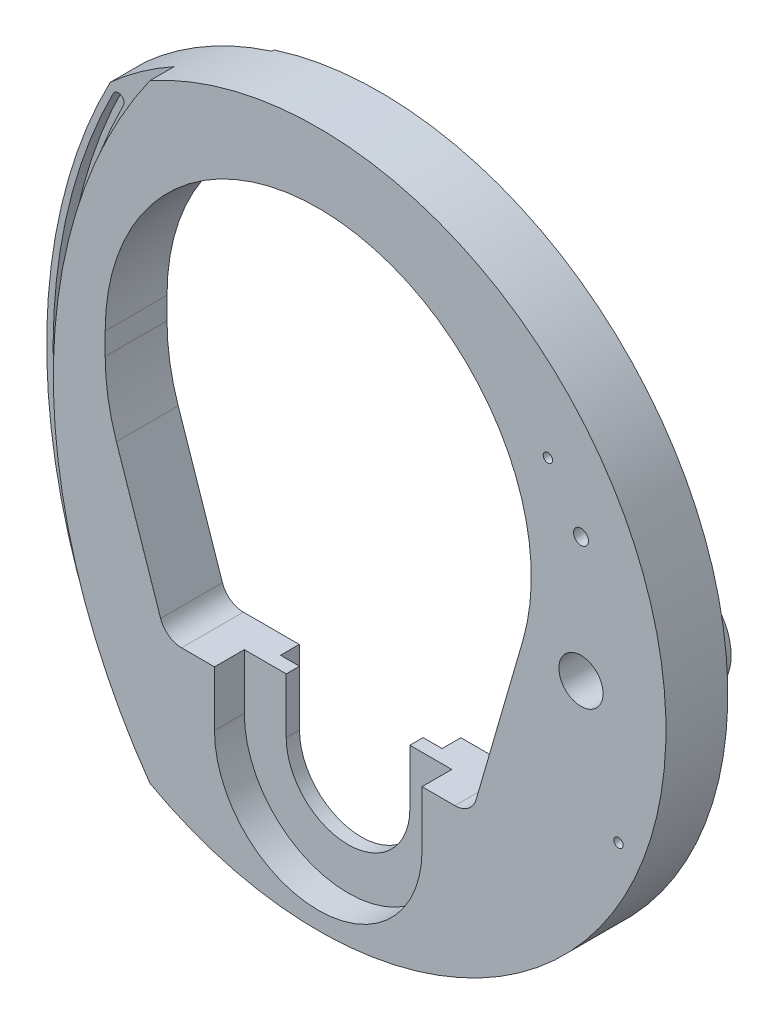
from build123d import *
from build123d.topology import SkipClean

# Parameters (mm, degrees)
ESQUISSE1_R                         = 10
BASE_EXTRUSION_DEPTH                = 28
ENL_V_MAT_EXTRU_3_DEPTH             = 8.5
ENL_V_MAT_EXTRU_4_DEPTH             = 13.5
BOSS_EXTRU_2_START                  = 16
ESQUISSE11_R                        = 24
ESQUISSE11_R_2                      = 10
BOSS_EXTRU_2_DEPTH                  = 16
CONG_2_R                            = 2
ENL_V_MAT_EXTRU_5_DEPTH             = 1
ENL_V_MAT_EXTRU_9_DEPTH             = 1.5
ENL_V_START                         = -11
ENL_V_MAT_EXTRU_10_DEPTH            = 11
ENL_V_START_2                       = -5
ENL_V_MAT_EXTRU_11_DEPTH            = 5
ESQUISSE18_R                        = 2
ENL_V_MAT_EXTRU_12_DEPTH            = 4
CHANFREIN1_SIZE                     = 1.5
ESQUISSE19_R                        = 5.6
ENL_V_MAT_EXTRU_13_DEPTH            = 16
CHANFREIN2_SIZE                     = 0.3
DIAM_TRE_DU_PER_AGE_6_7_6_75_1_D    = 6.75
DIAM_TRE_DU_PER_AGE_4_2_4_2_1_D     = 4.2
DIAM_TRE_DU_PER_AGE_4_2_4_2_1_DEPTH = 14
DIAM_TRE_DU_PER_AGE_4_2_4_2_1_TIP   = 1.2618073
DIAM_TRE_DU_PER_AGE_4_0_4_1_D       = 4
DIAM_TRE_DU_PER_AGE_4_0_4_1_DEPTH   = 13
DIAM_TRE_DU_PER_AGE_4_0_4_1_TIP     = 1.201721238
EXTRUSION1_DEPTH                    = 2


with BuildPart() as part:
    # Esquisse1 → Base-Extrusion (new body)
    with BuildSketch(Plane.XY):
        with BuildLine():
            ThreePointArc((-105.217436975, -146.69872421), (157.5, -29.5), (-105.217436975, 87.69872421))
            ThreePointArc((-105.217436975, 87.69872421), (-134, -29.5), (-105.217436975, -146.69872421))
        make_face()
        with Locations((119, -29.5)):
            Circle(ESQUISSE1_R, mode=Mode.SUBTRACT)
        with BuildLine():
            Line((-28, -107), (-61.915, -107))
            ThreePointArc((-61.915, -107), (-67.745910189, -105.124068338), (-71.38914257, -100.200097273))
            Line((-71.38914257, -100.200097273), (-91.425475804, -40.880938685))
            ThreePointArc((-91.425475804, -40.880938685), (-95.222918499, -25.647549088), (-96.5, -10))
            Line((-96.5, -10), (-96.5, 0))
            ThreePointArc((-96.5, 0), (13.585184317, 95.53895942), (92.674979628, -26.899779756))
            Line((92.674979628, -26.899779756), (71.518624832, -99.787541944))
            ThreePointArc((71.518624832, -99.787541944), (67.920188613, -104.99610591), (61.915, -107))
            Line((61.915, -107), (28, -107))
            Line((28, -107), (28, -132))
            ThreePointArc((28, -132), (0, -160), (-28, -132))
            Line((-28, -132), (-28, -107))
        make_face(mode=Mode.SUBTRACT)
    extrude(amount=BASE_EXTRUSION_DEPTH)

    # Esquisse9 → Enl_v. mat.-Extru.3 (cut)
    with BuildSketch(Plane(origin=(0, 0, 0), x_dir=(-1, 0, 0), z_dir=(0, 0, -1))):
        with BuildLine():
            Line((36.6, -95.936551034), (36.6, -153.5))
            ThreePointArc((36.6, -153.5), (32.206601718, -164.106601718), (21.6, -168.5))
            Line((21.6, -168.5), (-21.6, -168.5))
            ThreePointArc((-21.6, -168.5), (-32.206601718, -164.106601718), (-36.6, -153.5))
            Line((-36.6, -153.5), (-36.6, -95.936551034))
            Line((-36.6, -95.936551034), (36.6, -95.936551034))
        make_face()
    extrude(amount=-ENL_V_MAT_EXTRU_3_DEPTH, mode=Mode.SUBTRACT)

    # Esquisse10 → Enl_v. mat.-Extru.4 (cut)
    with BuildSketch(Plane.XY.offset(28)):
        with BuildLine():
            Line((47, -97.08178789), (47, -132))
            ThreePointArc((47, -132), (0, -179), (-47, -132))
            Line((-47, -132), (-47, -97.08178789))
            Line((-47, -97.08178789), (47, -97.08178789))
        make_face()
    extrude(amount=-ENL_V_MAT_EXTRU_4_DEPTH, mode=Mode.SUBTRACT)

    # Esquisse11 → Boss.-Extru.2 (add)
    with SkipClean():  # the faces are left unmerged after this step: merging them gives an invalid solid
        with BuildSketch(Plane(origin=(0, 0, 0), x_dir=(-1, 0, 0), z_dir=(0, 0, -1)).offset(BOSS_EXTRU_2_START)):
            with Locations(Location((-119.012549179, -29.470229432, 0), (0, 0, 180))):
                Circle(ESQUISSE11_R)
            with Locations((-119, -29.5)):
                Circle(ESQUISSE11_R_2, mode=Mode.SUBTRACT)
        extrude(amount=-BOSS_EXTRU_2_DEPTH)

    # Cong_2
    cong_2_edges = [part.edges().sort_by_distance(p)[0] for p in [
        (95.012549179, -29.470229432, 0),
    ]]
    fillet(cong_2_edges, radius=CONG_2_R)

    # Esquisse14 → Enl_v. mat.-Extru.5 (cut)
    with SkipClean():  # the faces are left unmerged after this step: merging them gives an invalid solid
        with BuildSketch(Plane(origin=(0, 0, 0), x_dir=(-1, 0, 0), z_dir=(0, 0, -1))):
            with BuildLine():
                Line((40.981248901, 128), (134, 128))
                Line((134, 128), (134, -187))
                Line((134, -187), (40.981248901, -187))
                ThreePointArc((40.981248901, -187), (105.5, -29.5), (40.981248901, 128))
            make_face()
        extrude(amount=-ENL_V_MAT_EXTRU_5_DEPTH, mode=Mode.SUBTRACT)

    # Esquisse15 → Enl_v. mat.-Extru.9 (cut)
    with SkipClean():  # the faces are left unmerged after this step: merging them gives an invalid solid
        with BuildSketch(Plane(origin=(0, 0, 0), x_dir=(-1, 0, 0), z_dir=(0, 0, -1))):
            with BuildLine():
                ThreePointArc((94.77631068, -98.056101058), (105.374618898, -21.997973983), (89.71961165, 53.182366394))
                ThreePointArc((89.71961165, 53.182366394), (93.789856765, 62.592897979), (103.20038835, 58.522652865))
                ThreePointArc((103.20038835, 58.522652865), (119.866520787, -21.513433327), (108.58368932, -102.48400068))
                ThreePointArc((108.58368932, -102.48400068), (99.466050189, -107.173740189), (94.77631068, -98.056101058))
            make_face()
        extrude(amount=-ENL_V_MAT_EXTRU_9_DEPTH, mode=Mode.SUBTRACT)

    # Esquisse16 → Enl_v. mat.-Extru.10 (cut)
    with SkipClean():  # the faces are left unmerged after this step: merging them gives an invalid solid
        with BuildSketch(Plane.XY.offset(28).offset(ENL_V_START)):
            with BuildLine():
                Line((-59.67376061, 129.2346442), (-150.134824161, 125.724030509))
                Line((-150.134824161, 125.724030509), (-132.956271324, -197.805381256))
                Line((-132.956271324, -197.805381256), (-50.688828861, -197.805381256))
                ThreePointArc((-50.688828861, -197.805381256), (-119.909853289, -36.063688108), (-59.67376061, 129.2346442))
            make_face()
        extrude(amount=ENL_V_MAT_EXTRU_10_DEPTH, mode=Mode.SUBTRACT)

    # Esquisse17 → Enl_v. mat.-Extru.11 (cut)
    with SkipClean():  # the faces are left unmerged after this step: merging them gives an invalid solid
        with BuildSketch(Plane.XY.offset(17).offset(ENL_V_START_2)):
            with BuildLine():
                ThreePointArc((-99.231513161, 81.635127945), (-125.648369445, -40.598888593), (-88.27210084, -159.938821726))
                ThreePointArc((-88.27210084, -159.938821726), (-93.765309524, -156.047685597), (-99.087226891, -151.925371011))
                ThreePointArc((-99.087226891, -151.925371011), (-131.048723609, -34.564170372), (-103.86525701, 83.994877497))
                ThreePointArc((-103.86525701, 83.994877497), (-100.368510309, 85.131874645), (-99.231513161, 81.635127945))
            make_face()
        extrude(amount=ENL_V_MAT_EXTRU_11_DEPTH, mode=Mode.SUBTRACT)

    # Esquisse18 → Enl_v. mat.-Extru.12 (cut)
    with SkipClean():  # the faces are left unmerged after this step: merging them gives an invalid solid
        with BuildSketch(Plane(origin=(0, 0, 0), x_dir=(-1, 0, 0), z_dir=(0, 0, -1))):
            with Locations((43.6, -117)):
                Circle(ESQUISSE18_R)
            with Locations((-43.6, -117)):
                Circle(ESQUISSE18_R)
        extrude(amount=-ENL_V_MAT_EXTRU_12_DEPTH, mode=Mode.SUBTRACT)

    # Chanfrein1
    chanfrein1_edges = [part.edges().sort_by_distance(p)[0] for p in [
        (-41.6, -117, 0),
        (45.6, -117, 0),
    ]]
    chamfer(chanfrein1_edges, length=CHANFREIN1_SIZE)

    # Esquisse19 → Enl_v. mat.-Extru.13 (cut)
    with SkipClean():  # the faces are left unmerged after this step: merging them gives an invalid solid
        with BuildSketch(Plane(origin=(0, 0, 0), x_dir=(-1, 0, 0), z_dir=(0, 0, -1))):
            with Locations((54.6, -132)):
                Circle(ESQUISSE19_R)
            with Locations((-54.6, -132)):
                Circle(ESQUISSE19_R)
        extrude(amount=-ENL_V_MAT_EXTRU_13_DEPTH, mode=Mode.SUBTRACT)

    # Chanfrein2
    chanfrein2_edges = [part.edges().sort_by_distance(p)[0] for p in [
        (-49, -132, 0),
        (60.2, -132, 0),
    ]]
    chamfer(chanfrein2_edges, length=CHANFREIN2_SIZE)

    # Diam_tre du per_age _6.7 _6.75_1 (through all)
    with Locations(Plane(origin=(0, 0, 0), x_dir=(-1, 0, 0), z_dir=(0, 0, -1))):
        with Locations((-119, 27)):
            Hole(DIAM_TRE_DU_PER_AGE_6_7_6_75_1_D / 2)

    # Diam_tre du per_age _4.2 _4.2_1
    with Locations(Plane.XY.offset(28)):
        with Locations((104, 50.5), (136, -84.5)):
            Hole(DIAM_TRE_DU_PER_AGE_4_2_4_2_1_D / 2, depth=DIAM_TRE_DU_PER_AGE_4_2_4_2_1_DEPTH)
            with Locations((0, 0, -(DIAM_TRE_DU_PER_AGE_4_2_4_2_1_DEPTH + DIAM_TRE_DU_PER_AGE_4_2_4_2_1_TIP / 2))):  # 118° drill point
                Cone(0, DIAM_TRE_DU_PER_AGE_4_2_4_2_1_D / 2, DIAM_TRE_DU_PER_AGE_4_2_4_2_1_TIP, mode=Mode.SUBTRACT)

    # Diam_tre du per_age _4.0 _4_1
    with Locations(Plane(origin=(0, 0, 0), x_dir=(-1, 0, 0), z_dir=(0, 0, -1))):
        with Locations((-43.6, -117), (43.6, -117)):
            Hole(DIAM_TRE_DU_PER_AGE_4_0_4_1_D / 2, depth=DIAM_TRE_DU_PER_AGE_4_0_4_1_DEPTH)
            with Locations((0, 0, -(DIAM_TRE_DU_PER_AGE_4_0_4_1_DEPTH + DIAM_TRE_DU_PER_AGE_4_0_4_1_TIP / 2))):  # 118° drill point
                Cone(0, DIAM_TRE_DU_PER_AGE_4_0_4_1_D / 2, DIAM_TRE_DU_PER_AGE_4_0_4_1_TIP, mode=Mode.SUBTRACT)

    # Esquisse26 → Extrusion1 (cut)
    with SkipClean():  # the faces are left unmerged after this step: merging them gives an invalid solid
        with BuildSketch(Plane(origin=(0, 0, 0), x_dir=(-1, 0, 0), z_dir=(0, 0, -1))):
            with BuildLine():
                Line((-25, 122.5), (25, 122.5))
                ThreePointArc((25, 122.5), (26.414213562, 121.914213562), (27, 120.5))
                Line((27, 120.5), (27, 102))
                ThreePointArc((27, 102), (26.414213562, 100.585786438), (25, 100))
                Line((25, 100), (-25, 100))
                ThreePointArc((-25, 100), (-26.414213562, 100.585786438), (-27, 102))
                Line((-27, 102), (-27, 120.5))
                ThreePointArc((-27, 120.5), (-26.414213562, 121.914213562), (-25, 122.5))
            make_face()
        extrude(amount=-EXTRUSION1_DEPTH, mode=Mode.SUBTRACT)


solid = part.part
